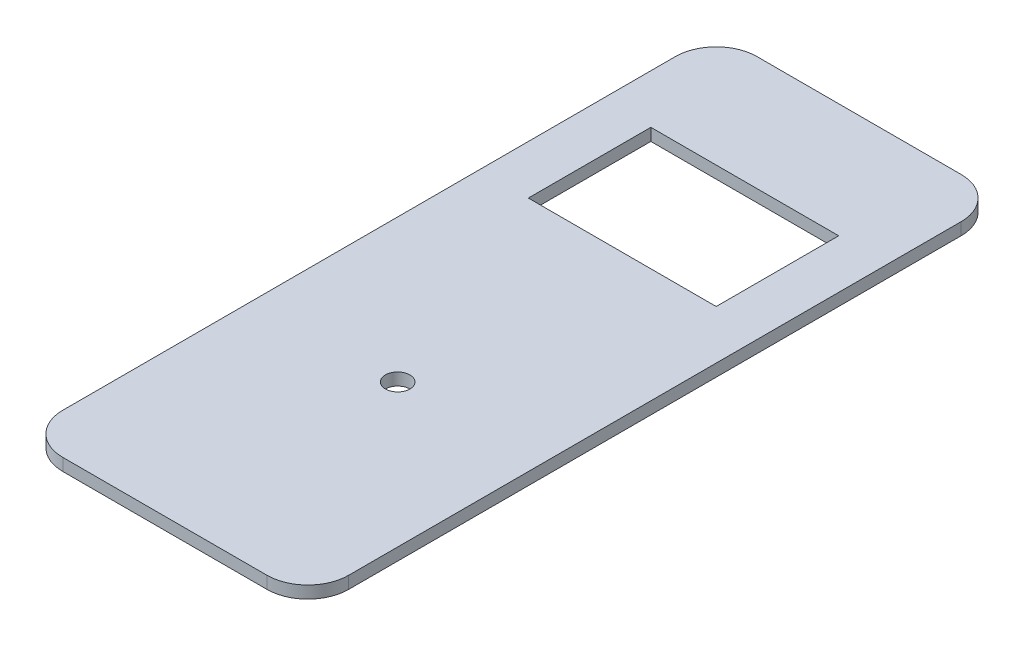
from build123d import *

# Parameters (mm, degrees)
SKIZZE1_W                       = 35
SKIZZE1_H                       = 85
SKIZZE1_R                       = 1.5
SKIZZE1_W_2                     = 23
SKIZZE1_H_2                     = 15
AUFSATZ_LINEAR_AUSTRAGEN1_DEPTH = 1.5
VERRUNDUNG1_R                   = 5


with BuildPart() as part:
    # Skizze1 → Aufsatz-Linear austragen1 (new body)
    with BuildSketch(Plane(origin=(0, 0, 0), x_dir=(1, 0, 0), z_dir=(0, 1, 0))):
        with Locations((0, -42.5)):
            Rectangle(SKIZZE1_W, SKIZZE1_H)
        with Locations(Location((0, -56.5, 0), (0, 0, 270))):
            Circle(SKIZZE1_R, mode=Mode.SUBTRACT)
        with Locations((0, -21.5)):
            Rectangle(SKIZZE1_W_2, SKIZZE1_H_2, mode=Mode.SUBTRACT)
    extrude(amount=AUFSATZ_LINEAR_AUSTRAGEN1_DEPTH)

    # Verrundung1
    verrundung1_edges = [part.edges().sort_by_distance(p)[0] for p in [
        (-17.5, 0.75, 0),
        (17.5, 0.75, 0),
        (17.5, 0.75, 85),
        (-17.5, 0.75, 85),
    ]]
    fillet(verrundung1_edges, radius=VERRUNDUNG1_R)


solid = part.part
